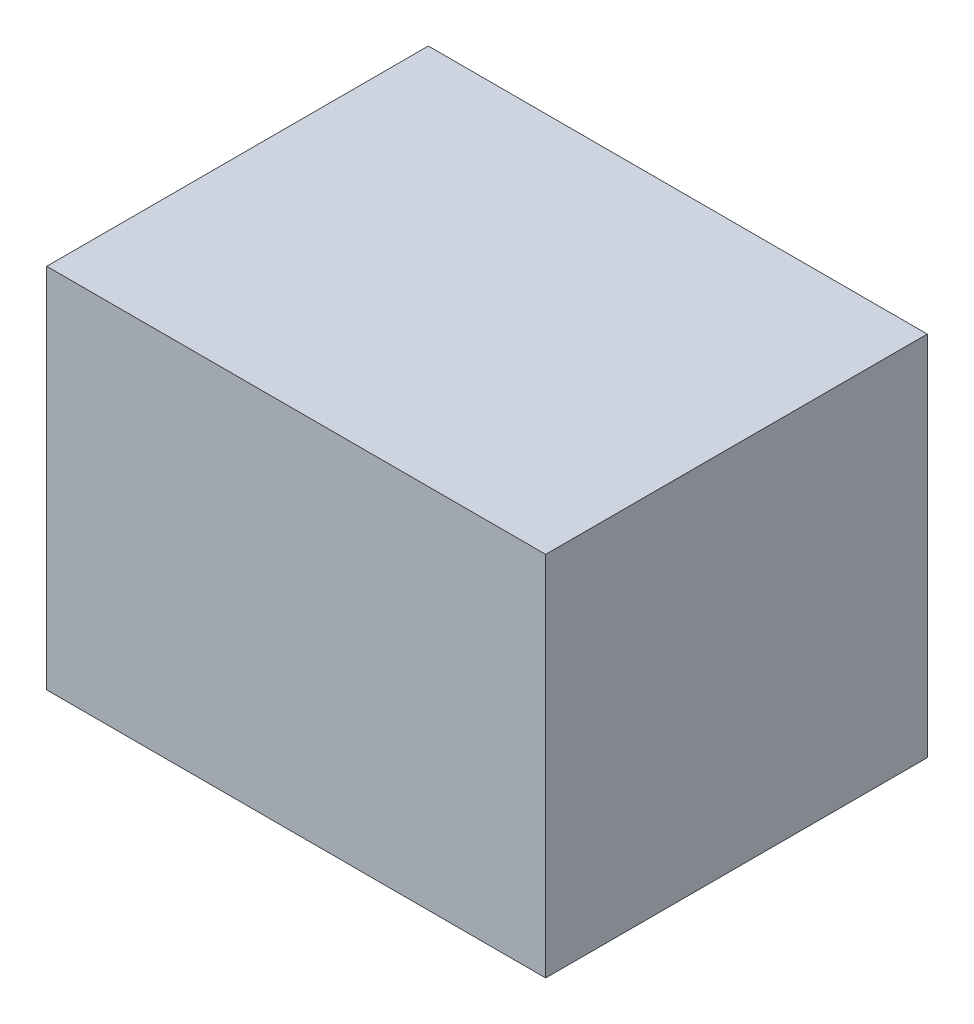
ISO-10303-21;
HEADER;
FILE_DESCRIPTION(('STEP AP214'),'2;1');
FILE_NAME('part.step','',(''),(''),'','','');
FILE_SCHEMA(('AUTOMOTIVE_DESIGN { 1 0 10303 214 1 1 1 1 }'));
ENDSEC;
DATA;
#1=APPLICATION_CONTEXT('core data for automotive mechanical design processes');
#2=APPLICATION_PROTOCOL_DEFINITION('international standard','automotive_design',2000,#1);
#3=PRODUCT_CONTEXT('',#1,'mechanical');
#4=PRODUCT('Part','Part','',(#3));
#5=PRODUCT_RELATED_PRODUCT_CATEGORY('part','',(#4));
#6=PRODUCT_DEFINITION_FORMATION('','',#4);
#7=PRODUCT_DEFINITION_CONTEXT('part definition',#1,'design');
#8=PRODUCT_DEFINITION('design','',#6,#7);
#9=PRODUCT_DEFINITION_SHAPE('','',#8);
#10=(LENGTH_UNIT() NAMED_UNIT(*) SI_UNIT(.MILLI.,.METRE.));
#11=(NAMED_UNIT(*) PLANE_ANGLE_UNIT() SI_UNIT($,.RADIAN.));
#12=(NAMED_UNIT(*) SI_UNIT($,.STERADIAN.) SOLID_ANGLE_UNIT());
#13=UNCERTAINTY_MEASURE_WITH_UNIT(LENGTH_MEASURE(1.E-05),#10,'distance_accuracy_value','');
#14=(GEOMETRIC_REPRESENTATION_CONTEXT(3) GLOBAL_UNCERTAINTY_ASSIGNED_CONTEXT((#13)) GLOBAL_UNIT_ASSIGNED_CONTEXT((#10,
#11,#12)) REPRESENTATION_CONTEXT('',''));
#15=CARTESIAN_POINT('',(0.,0.,0.));
#16=DIRECTION('',(0.,0.,1.));
#17=DIRECTION('',(1.,0.,0.));
#18=AXIS2_PLACEMENT_3D('',#15,#16,#17);
#19=CARTESIAN_POINT('',(0.,50.,52.));
#20=DIRECTION('',(-1.,0.,0.));
#21=DIRECTION('',(0.,0.,1.));
#22=AXIS2_PLACEMENT_3D('',#19,#20,#21);
#23=PLANE('',#22);
#24=DIRECTION('',(0.,0.,-1.));
#25=VECTOR('',#24,1.);
#26=CARTESIAN_POINT('',(0.,0.,52.));
#27=LINE('',#26,#25);
#28=CARTESIAN_POINT('',(0.,0.,52.));
#29=VERTEX_POINT('',#28);
#30=CARTESIAN_POINT('',(0.,0.,0.));
#31=VERTEX_POINT('',#30);
#32=EDGE_CURVE('E94',#29,#31,#27,.T.);
#33=ORIENTED_EDGE('',*,*,#32,.T.);
#34=DIRECTION('',(0.,-1.,0.));
#35=VECTOR('',#34,1.);
#36=CARTESIAN_POINT('',(0.,50.,0.));
#37=LINE('',#36,#35);
#38=CARTESIAN_POINT('',(0.,50.,0.));
#39=VERTEX_POINT('',#38);
#40=EDGE_CURVE('E11',#39,#31,#37,.T.);
#41=ORIENTED_EDGE('',*,*,#40,.F.);
#42=DIRECTION('',(0.,0.,-1.));
#43=VECTOR('',#42,1.);
#44=CARTESIAN_POINT('',(0.,50.,52.));
#45=LINE('',#44,#43);
#46=CARTESIAN_POINT('',(0.,50.,52.));
#47=VERTEX_POINT('',#46);
#48=EDGE_CURVE('E82',#47,#39,#45,.T.);
#49=ORIENTED_EDGE('',*,*,#48,.F.);
#50=DIRECTION('',(0.,-1.,0.));
#51=VECTOR('',#50,1.);
#52=CARTESIAN_POINT('',(0.,50.,52.));
#53=LINE('',#52,#51);
#54=EDGE_CURVE('E90',#47,#29,#53,.T.);
#55=ORIENTED_EDGE('',*,*,#54,.T.);
#56=EDGE_LOOP('',(#33,#41,#49,#55));
#57=FACE_BOUND('',#56,.T.);
#58=ADVANCED_FACE('F31',(#57),#23,.F.);
#59=CARTESIAN_POINT('',(0.,50.,0.));
#60=DIRECTION('',(0.,0.,1.));
#61=DIRECTION('',(1.,0.,0.));
#62=AXIS2_PLACEMENT_3D('',#59,#60,#61);
#63=PLANE('',#62);
#64=DIRECTION('',(-1.,0.,0.));
#65=VECTOR('',#64,1.);
#66=CARTESIAN_POINT('',(0.,0.,0.));
#67=LINE('',#66,#65);
#68=CARTESIAN_POINT('',(-68.,0.,0.));
#69=VERTEX_POINT('',#68);
#70=EDGE_CURVE('E86',#31,#69,#67,.T.);
#71=ORIENTED_EDGE('',*,*,#70,.T.);
#72=DIRECTION('',(0.,-1.,0.));
#73=VECTOR('',#72,1.);
#74=CARTESIAN_POINT('',(-68.,50.,0.));
#75=LINE('',#74,#73);
#76=CARTESIAN_POINT('',(-68.,50.,0.));
#77=VERTEX_POINT('',#76);
#78=EDGE_CURVE('E39',#77,#69,#75,.T.);
#79=ORIENTED_EDGE('',*,*,#78,.F.);
#80=DIRECTION('',(-1.,0.,0.));
#81=VECTOR('',#80,1.);
#82=CARTESIAN_POINT('',(0.,50.,0.));
#83=LINE('',#82,#81);
#84=EDGE_CURVE('E77',#39,#77,#83,.T.);
#85=ORIENTED_EDGE('',*,*,#84,.F.);
#86=ORIENTED_EDGE('',*,*,#40,.T.);
#87=EDGE_LOOP('',(#71,#79,#85,#86));
#88=FACE_BOUND('',#87,.T.);
#89=ADVANCED_FACE('F85',(#88),#63,.F.);
#90=CARTESIAN_POINT('',(-68.,50.,0.));
#91=DIRECTION('',(1.,0.,0.));
#92=DIRECTION('',(0.,0.,-1.));
#93=AXIS2_PLACEMENT_3D('',#90,#91,#92);
#94=PLANE('',#93);
#95=DIRECTION('',(0.,0.,1.));
#96=VECTOR('',#95,1.);
#97=CARTESIAN_POINT('',(-68.,0.,0.));
#98=LINE('',#97,#96);
#99=CARTESIAN_POINT('',(-68.,0.,52.));
#100=VERTEX_POINT('',#99);
#101=EDGE_CURVE('E64',#69,#100,#98,.T.);
#102=ORIENTED_EDGE('',*,*,#101,.T.);
#103=DIRECTION('',(0.,-1.,0.));
#104=VECTOR('',#103,1.);
#105=CARTESIAN_POINT('',(-68.,50.,52.));
#106=LINE('',#105,#104);
#107=CARTESIAN_POINT('',(-68.,50.,52.));
#108=VERTEX_POINT('',#107);
#109=EDGE_CURVE('E87',#108,#100,#106,.T.);
#110=ORIENTED_EDGE('',*,*,#109,.F.);
#111=DIRECTION('',(0.,0.,1.));
#112=VECTOR('',#111,1.);
#113=CARTESIAN_POINT('',(-68.,50.,0.));
#114=LINE('',#113,#112);
#115=EDGE_CURVE('E80',#77,#108,#114,.T.);
#116=ORIENTED_EDGE('',*,*,#115,.F.);
#117=ORIENTED_EDGE('',*,*,#78,.T.);
#118=EDGE_LOOP('',(#102,#110,#116,#117));
#119=FACE_BOUND('',#118,.T.);
#120=ADVANCED_FACE('F88',(#119),#94,.F.);
#121=CARTESIAN_POINT('',(-68.,50.,52.));
#122=DIRECTION('',(0.,0.,-1.));
#123=DIRECTION('',(-1.,0.,0.));
#124=AXIS2_PLACEMENT_3D('',#121,#122,#123);
#125=PLANE('',#124);
#126=DIRECTION('',(1.,0.,0.));
#127=VECTOR('',#126,1.);
#128=CARTESIAN_POINT('',(-68.,0.,52.));
#129=LINE('',#128,#127);
#130=EDGE_CURVE('E70',#100,#29,#129,.T.);
#131=ORIENTED_EDGE('',*,*,#130,.T.);
#132=ORIENTED_EDGE('',*,*,#54,.F.);
#133=DIRECTION('',(1.,0.,0.));
#134=VECTOR('',#133,1.);
#135=CARTESIAN_POINT('',(-68.,50.,52.));
#136=LINE('',#135,#134);
#137=EDGE_CURVE('E47',#108,#47,#136,.T.);
#138=ORIENTED_EDGE('',*,*,#137,.F.);
#139=ORIENTED_EDGE('',*,*,#109,.T.);
#140=EDGE_LOOP('',(#131,#132,#138,#139));
#141=FACE_BOUND('',#140,.T.);
#142=ADVANCED_FACE('F101',(#141),#125,.F.);
#143=CARTESIAN_POINT('',(0.,50.,0.));
#144=DIRECTION('',(0.,1.,0.));
#145=DIRECTION('',(0.,0.,1.));
#146=AXIS2_PLACEMENT_3D('',#143,#144,#145);
#147=PLANE('',#146);
#148=ORIENTED_EDGE('',*,*,#48,.T.);
#149=ORIENTED_EDGE('',*,*,#84,.T.);
#150=ORIENTED_EDGE('',*,*,#115,.T.);
#151=ORIENTED_EDGE('',*,*,#137,.T.);
#152=EDGE_LOOP('',(#148,#149,#150,#151));
#153=FACE_BOUND('',#152,.T.);
#154=ADVANCED_FACE('F78',(#153),#147,.T.);
#155=CARTESIAN_POINT('',(0.,0.,0.));
#156=DIRECTION('',(0.,1.,0.));
#157=DIRECTION('',(0.,0.,1.));
#158=AXIS2_PLACEMENT_3D('',#155,#156,#157);
#159=PLANE('',#158);
#160=ORIENTED_EDGE('',*,*,#32,.F.);
#161=ORIENTED_EDGE('',*,*,#130,.F.);
#162=ORIENTED_EDGE('',*,*,#101,.F.);
#163=ORIENTED_EDGE('',*,*,#70,.F.);
#164=EDGE_LOOP('',(#160,#161,#162,#163));
#165=FACE_BOUND('',#164,.T.);
#166=ADVANCED_FACE('F104',(#165),#159,.F.);
#167=CLOSED_SHELL('',(#58,#89,#120,#142,#154,#166));
#168=MANIFOLD_SOLID_BREP('B2',#167);
#169=ADVANCED_BREP_SHAPE_REPRESENTATION('',(#18,#168),#14);
#170=SHAPE_DEFINITION_REPRESENTATION(#9,#169);
ENDSEC;
END-ISO-10303-21;
